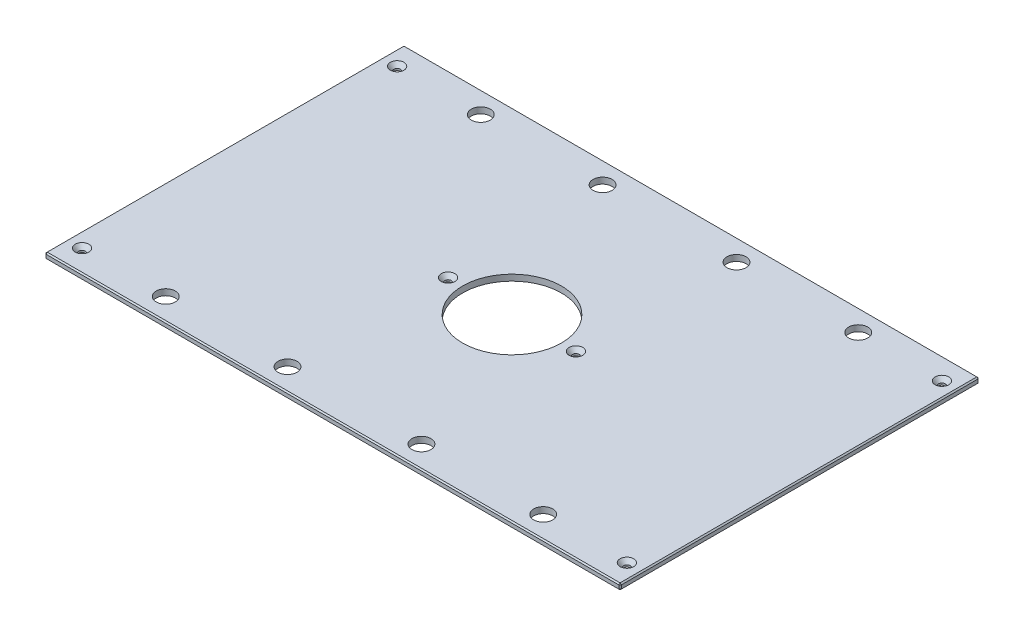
from build123d import *

# Parameters (mm, degrees)
SKETCH1_W                                     = 600.075
SKETCH1_H                                     = 374.65
BOSS_EXTRUDE1_DEPTH                           = 6.35
SKETCH13_R                                    = 51.562
CUT_EXTRUDE6_DEPTH                            = 354.770376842
F_25_32_0_78125_DIAMETER_HOLE1_D              = 19.84375
CHAMFER2_SIZE                                 = 1.27
CSK_FOR_1_4_FLAT_HEAD_MACHINE_SCREW1_AT_COUNT = 2
CSK_FOR_1_4_FLAT_HEAD_MACHINE_SCREW1_AT_PITCH = 328.60996
CSK_FOR_1_4_FLAT_HEAD_MACHINE_SCREW1_2_COUNT  = 2
CSK_FOR_1_4_FLAT_HEAD_MACHINE_SCREW1_2_PITCH  = 656.489003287
CSK_FOR_1_4_FLAT_HEAD_MACHINE_SCREW1_3_COUNT  = 2
CSK_FOR_1_4_FLAT_HEAD_MACHINE_SCREW1_3_PITCH  = 387.405572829
CSK_FOR_1_4_FLAT_HEAD_MACHINE_SCREW1_4_COUNT  = 2
CSK_FOR_1_4_FLAT_HEAD_MACHINE_SCREW1_4_PITCH  = 272.574648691
CSK_FOR_1_4_FLAT_HEAD_MACHINE_SCREW1_5_COUNT  = 2
CSK_FOR_1_4_FLAT_HEAD_MACHINE_SCREW1_5_PITCH  = 568.325
CSK_FOR_1_4_FLAT_HEAD_MACHINE_SCREW1_6_COUNT  = 2
CSK_FOR_1_4_FLAT_HEAD_MACHINE_SCREW1_6_PITCH  = 481.0125
CSK_FOR_1_4_FLAT_HEAD_MACHINE_SCREW1_7_COUNT  = 2
CSK_FOR_1_4_FLAT_HEAD_MACHINE_SCREW1_7_PITCH  = 582.544016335


with BuildPart() as part:
    # Sketch1 → Boss-Extrude1 (new body)
    with BuildSketch(Plane(origin=(0, 0, 0), x_dir=(1, 0, 0), z_dir=(0, 1, 0))):
        Rectangle(SKETCH1_W, SKETCH1_H)
    extrude(amount=BOSS_EXTRUDE1_DEPTH)

    # Sketch13 → Cut-Extrude6 (cut, through all)
    with BuildSketch(Plane(origin=(0, 6.35, 0), x_dir=(1, 0, 0), z_dir=(0, 1, 0))):
        with Locations(Location((0, 0, 0), (0, 0, 270))):
            Circle(SKETCH13_R)
    extrude(amount=-CUT_EXTRUDE6_DEPTH, mode=Mode.SUBTRACT)

    # 25_32 _0.78125_ Diameter Hole1 (through all)
    with Locations(Plane(origin=(0, 6.35, 0), x_dir=(1, 0, 0), z_dir=(0, 1, 0))):
        with Locations((196.85, 164.30498), (-196.85, 164.30498), (196.85, -164.30498), (-196.85, -164.30498), (-69.85, 164.30498), (69.85, 164.30498), (69.85, -164.30498), (-69.85, -164.30498)):
            Hole(F_25_32_0_78125_DIAMETER_HOLE1_D / 2)

    # Chamfer2
    chamfer2_edges = [part.edges().sort_by_distance(p)[0] for p in [
        (300.0375, 6.35, 0),
        (0, 6.35, -187.325),
        (-300.0375, 6.35, 0),
        (0, 0, -187.325),
        (300.0375, 0, 0),
        (0, 0, 187.325),
        (-300.0375, 0, 0),
        (0, 6.35, 187.325),
        (-300.0375, 3.175, -187.325),
        (300.0375, 3.175, -187.325),
        (300.0375, 3.175, 187.325),
        (-300.0375, 3.175, 187.325),
    ]]
    chamfer(chamfer2_edges, length=CHAMFER2_SIZE)

    # Sketch24 → CSK for 1_4 Flat Head Machine Screw1 (revolve, cut)
    with BuildSketch(Plane(origin=(284.1625, 6.35, -164.30498), x_dir=(0, 0, 1), z_dir=(1, 0, 0))):
        Polygon((0, 0), (0, 6.35), (3.3782, 6.35), (3.3782, 4.324464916), (7.1374, 0), align=None)
    csk_for_1_4_flat_head_machine_screw1 = revolve(axis=Axis((284.1625, 12.7, -164.30498), (0, -1, 0)), mode=Mode.SUBTRACT)

    # CSK for 1_4 Flat Head Machine Screw1 at: CSK for 1_4 Flat Head Machine Screw1 ×2
    with Locations(*[(0, 0, i * CSK_FOR_1_4_FLAT_HEAD_MACHINE_SCREW1_AT_PITCH) for i in range(1, CSK_FOR_1_4_FLAT_HEAD_MACHINE_SCREW1_AT_COUNT)]):
        add(csk_for_1_4_flat_head_machine_screw1, mode=Mode.SUBTRACT)

    # CSK for 1_4 Flat Head Machine Screw1 2: CSK for 1_4 Flat Head Machine Screw1 ×2
    with Locations(*[Vector(-0.8657037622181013, 0, 0.5005566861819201) * (i * CSK_FOR_1_4_FLAT_HEAD_MACHINE_SCREW1_2_PITCH) for i in range(1, CSK_FOR_1_4_FLAT_HEAD_MACHINE_SCREW1_2_COUNT)]):
        add(csk_for_1_4_flat_head_machine_screw1, mode=Mode.SUBTRACT)

    # CSK for 1_4 Flat Head Machine Screw1 3: CSK for 1_4 Flat Head Machine Screw1 ×2
    with Locations(*[Vector(-0.9056077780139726, 0, 0.4241162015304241) * (i * CSK_FOR_1_4_FLAT_HEAD_MACHINE_SCREW1_3_PITCH) for i in range(1, CSK_FOR_1_4_FLAT_HEAD_MACHINE_SCREW1_3_COUNT)]):
        add(csk_for_1_4_flat_head_machine_screw1, mode=Mode.SUBTRACT)

    # CSK for 1_4 Flat Head Machine Screw1 4: CSK for 1_4 Flat Head Machine Screw1 ×2
    with Locations(*[Vector(-0.7979006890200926, 0, 0.6027889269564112) * (i * CSK_FOR_1_4_FLAT_HEAD_MACHINE_SCREW1_4_PITCH) for i in range(1, CSK_FOR_1_4_FLAT_HEAD_MACHINE_SCREW1_4_COUNT)]):
        add(csk_for_1_4_flat_head_machine_screw1, mode=Mode.SUBTRACT)

    # CSK for 1_4 Flat Head Machine Screw1 5: CSK for 1_4 Flat Head Machine Screw1 ×2
    with Locations(*[(-i * CSK_FOR_1_4_FLAT_HEAD_MACHINE_SCREW1_5_PITCH, 0, 0) for i in range(1, CSK_FOR_1_4_FLAT_HEAD_MACHINE_SCREW1_5_COUNT)]):
        add(csk_for_1_4_flat_head_machine_screw1, mode=Mode.SUBTRACT)

    # CSK for 1_4 Flat Head Machine Screw1 6: CSK for 1_4 Flat Head Machine Screw1 ×2
    with Locations(*[(-i * CSK_FOR_1_4_FLAT_HEAD_MACHINE_SCREW1_6_PITCH, 0, 0) for i in range(1, CSK_FOR_1_4_FLAT_HEAD_MACHINE_SCREW1_6_COUNT)]):
        add(csk_for_1_4_flat_head_machine_screw1, mode=Mode.SUBTRACT)

    # CSK for 1_4 Flat Head Machine Screw1 7: CSK for 1_4 Flat Head Machine Screw1 ×2
    with Locations(*[Vector(-0.8257101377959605, 0, 0.5640946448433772) * (i * CSK_FOR_1_4_FLAT_HEAD_MACHINE_SCREW1_7_PITCH) for i in range(1, CSK_FOR_1_4_FLAT_HEAD_MACHINE_SCREW1_7_COUNT)]):
        add(csk_for_1_4_flat_head_machine_screw1, mode=Mode.SUBTRACT)


solid = part.part
